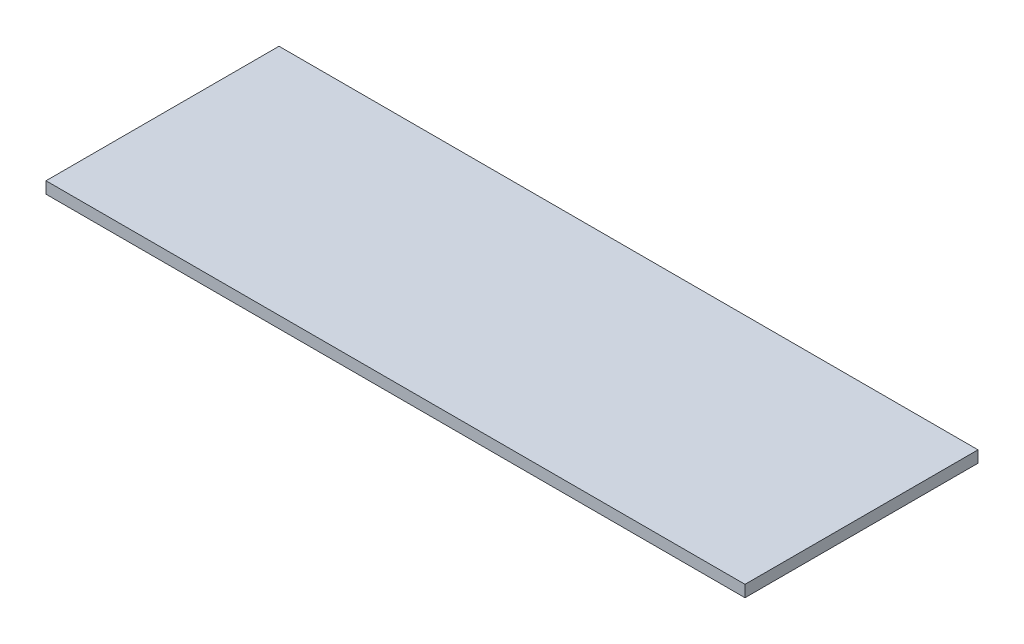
ISO-10303-21;
HEADER;
FILE_DESCRIPTION(('STEP AP214'),'2;1');
FILE_NAME('part.step','',(''),(''),'','','');
FILE_SCHEMA(('AUTOMOTIVE_DESIGN { 1 0 10303 214 1 1 1 1 }'));
ENDSEC;
DATA;
#1=APPLICATION_CONTEXT('core data for automotive mechanical design processes');
#2=APPLICATION_PROTOCOL_DEFINITION('international standard','automotive_design',2000,#1);
#3=PRODUCT_CONTEXT('',#1,'mechanical');
#4=PRODUCT('Part','Part','',(#3));
#5=PRODUCT_RELATED_PRODUCT_CATEGORY('part','',(#4));
#6=PRODUCT_DEFINITION_FORMATION('','',#4);
#7=PRODUCT_DEFINITION_CONTEXT('part definition',#1,'design');
#8=PRODUCT_DEFINITION('design','',#6,#7);
#9=PRODUCT_DEFINITION_SHAPE('','',#8);
#10=(LENGTH_UNIT() NAMED_UNIT(*) SI_UNIT(.MILLI.,.METRE.));
#11=(NAMED_UNIT(*) PLANE_ANGLE_UNIT() SI_UNIT($,.RADIAN.));
#12=(NAMED_UNIT(*) SI_UNIT($,.STERADIAN.) SOLID_ANGLE_UNIT());
#13=UNCERTAINTY_MEASURE_WITH_UNIT(LENGTH_MEASURE(1.E-05),#10,'distance_accuracy_value','');
#14=(GEOMETRIC_REPRESENTATION_CONTEXT(3) GLOBAL_UNCERTAINTY_ASSIGNED_CONTEXT((#13)) GLOBAL_UNIT_ASSIGNED_CONTEXT((#10,
#11,#12)) REPRESENTATION_CONTEXT('',''));
#15=CARTESIAN_POINT('',(0.,0.,0.));
#16=DIRECTION('',(0.,0.,1.));
#17=DIRECTION('',(1.,0.,0.));
#18=AXIS2_PLACEMENT_3D('',#15,#16,#17);
#19=CARTESIAN_POINT('',(0.,0.,1000.));
#20=DIRECTION('',(1.,0.,0.));
#21=DIRECTION('',(0.,0.,-1.));
#22=AXIS2_PLACEMENT_3D('',#19,#20,#21);
#23=PLANE('',#22);
#24=DIRECTION('',(0.,-1.,0.));
#25=VECTOR('',#24,1.);
#26=CARTESIAN_POINT('',(0.,0.,0.));
#27=LINE('',#26,#25);
#28=CARTESIAN_POINT('',(0.,50.,0.));
#29=VERTEX_POINT('',#28);
#30=CARTESIAN_POINT('',(0.,0.,0.));
#31=VERTEX_POINT('',#30);
#32=EDGE_CURVE('E95',#29,#31,#27,.T.);
#33=ORIENTED_EDGE('',*,*,#32,.T.);
#34=DIRECTION('',(0.,0.,-1.));
#35=VECTOR('',#34,1.);
#36=CARTESIAN_POINT('',(0.,0.,1000.));
#37=LINE('',#36,#35);
#38=CARTESIAN_POINT('',(0.,0.,1000.));
#39=VERTEX_POINT('',#38);
#40=EDGE_CURVE('E11',#39,#31,#37,.T.);
#41=ORIENTED_EDGE('',*,*,#40,.F.);
#42=DIRECTION('',(0.,-1.,0.));
#43=VECTOR('',#42,1.);
#44=CARTESIAN_POINT('',(0.,0.,1000.));
#45=LINE('',#44,#43);
#46=CARTESIAN_POINT('',(0.,50.,1000.));
#47=VERTEX_POINT('',#46);
#48=EDGE_CURVE('E83',#47,#39,#45,.T.);
#49=ORIENTED_EDGE('',*,*,#48,.F.);
#50=DIRECTION('',(0.,0.,-1.));
#51=VECTOR('',#50,1.);
#52=CARTESIAN_POINT('',(0.,50.,1000.));
#53=LINE('',#52,#51);
#54=EDGE_CURVE('E91',#47,#29,#53,.T.);
#55=ORIENTED_EDGE('',*,*,#54,.T.);
#56=EDGE_LOOP('',(#33,#41,#49,#55));
#57=FACE_BOUND('',#56,.T.);
#58=ADVANCED_FACE('F32',(#57),#23,.F.);
#59=CARTESIAN_POINT('',(0.,0.,1000.));
#60=DIRECTION('',(0.,1.,0.));
#61=DIRECTION('',(0.,0.,1.));
#62=AXIS2_PLACEMENT_3D('',#59,#60,#61);
#63=PLANE('',#62);
#64=DIRECTION('',(1.,0.,0.));
#65=VECTOR('',#64,1.);
#66=CARTESIAN_POINT('',(0.,0.,0.));
#67=LINE('',#66,#65);
#68=CARTESIAN_POINT('',(3000.,0.,0.));
#69=VERTEX_POINT('',#68);
#70=EDGE_CURVE('E87',#31,#69,#67,.T.);
#71=ORIENTED_EDGE('',*,*,#70,.T.);
#72=DIRECTION('',(0.,0.,-1.));
#73=VECTOR('',#72,1.);
#74=CARTESIAN_POINT('',(3000.,0.,1000.));
#75=LINE('',#74,#73);
#76=CARTESIAN_POINT('',(3000.,0.,1000.));
#77=VERTEX_POINT('',#76);
#78=EDGE_CURVE('E40',#77,#69,#75,.T.);
#79=ORIENTED_EDGE('',*,*,#78,.F.);
#80=DIRECTION('',(1.,0.,0.));
#81=VECTOR('',#80,1.);
#82=CARTESIAN_POINT('',(0.,0.,1000.));
#83=LINE('',#82,#81);
#84=EDGE_CURVE('E78',#39,#77,#83,.T.);
#85=ORIENTED_EDGE('',*,*,#84,.F.);
#86=ORIENTED_EDGE('',*,*,#40,.T.);
#87=EDGE_LOOP('',(#71,#79,#85,#86));
#88=FACE_BOUND('',#87,.T.);
#89=ADVANCED_FACE('F86',(#88),#63,.F.);
#90=CARTESIAN_POINT('',(3000.,0.,1000.));
#91=DIRECTION('',(-1.,0.,0.));
#92=DIRECTION('',(0.,0.,1.));
#93=AXIS2_PLACEMENT_3D('',#90,#91,#92);
#94=PLANE('',#93);
#95=DIRECTION('',(0.,1.,0.));
#96=VECTOR('',#95,1.);
#97=CARTESIAN_POINT('',(3000.,0.,0.));
#98=LINE('',#97,#96);
#99=CARTESIAN_POINT('',(3000.,50.,0.));
#100=VERTEX_POINT('',#99);
#101=EDGE_CURVE('E65',#69,#100,#98,.T.);
#102=ORIENTED_EDGE('',*,*,#101,.T.);
#103=DIRECTION('',(0.,0.,-1.));
#104=VECTOR('',#103,1.);
#105=CARTESIAN_POINT('',(3000.,50.,1000.));
#106=LINE('',#105,#104);
#107=CARTESIAN_POINT('',(3000.,50.,1000.));
#108=VERTEX_POINT('',#107);
#109=EDGE_CURVE('E88',#108,#100,#106,.T.);
#110=ORIENTED_EDGE('',*,*,#109,.F.);
#111=DIRECTION('',(0.,1.,0.));
#112=VECTOR('',#111,1.);
#113=CARTESIAN_POINT('',(3000.,0.,1000.));
#114=LINE('',#113,#112);
#115=EDGE_CURVE('E81',#77,#108,#114,.T.);
#116=ORIENTED_EDGE('',*,*,#115,.F.);
#117=ORIENTED_EDGE('',*,*,#78,.T.);
#118=EDGE_LOOP('',(#102,#110,#116,#117));
#119=FACE_BOUND('',#118,.T.);
#120=ADVANCED_FACE('F89',(#119),#94,.F.);
#121=CARTESIAN_POINT('',(0.,50.,1000.));
#122=DIRECTION('',(0.,-1.,0.));
#123=DIRECTION('',(0.,0.,-1.));
#124=AXIS2_PLACEMENT_3D('',#121,#122,#123);
#125=PLANE('',#124);
#126=DIRECTION('',(-1.,0.,0.));
#127=VECTOR('',#126,1.);
#128=CARTESIAN_POINT('',(0.,50.,0.));
#129=LINE('',#128,#127);
#130=EDGE_CURVE('E71',#100,#29,#129,.T.);
#131=ORIENTED_EDGE('',*,*,#130,.T.);
#132=ORIENTED_EDGE('',*,*,#54,.F.);
#133=DIRECTION('',(-1.,0.,0.));
#134=VECTOR('',#133,1.);
#135=CARTESIAN_POINT('',(0.,50.,1000.));
#136=LINE('',#135,#134);
#137=EDGE_CURVE('E48',#108,#47,#136,.T.);
#138=ORIENTED_EDGE('',*,*,#137,.F.);
#139=ORIENTED_EDGE('',*,*,#109,.T.);
#140=EDGE_LOOP('',(#131,#132,#138,#139));
#141=FACE_BOUND('',#140,.T.);
#142=ADVANCED_FACE('F102',(#141),#125,.F.);
#143=CARTESIAN_POINT('',(0.,0.,1000.));
#144=DIRECTION('',(0.,0.,-1.));
#145=DIRECTION('',(-1.,0.,0.));
#146=AXIS2_PLACEMENT_3D('',#143,#144,#145);
#147=PLANE('',#146);
#148=ORIENTED_EDGE('',*,*,#48,.T.);
#149=ORIENTED_EDGE('',*,*,#84,.T.);
#150=ORIENTED_EDGE('',*,*,#115,.T.);
#151=ORIENTED_EDGE('',*,*,#137,.T.);
#152=EDGE_LOOP('',(#148,#149,#150,#151));
#153=FACE_BOUND('',#152,.T.);
#154=ADVANCED_FACE('F79',(#153),#147,.F.);
#155=CARTESIAN_POINT('',(0.,0.,0.));
#156=DIRECTION('',(0.,0.,-1.));
#157=DIRECTION('',(-1.,0.,0.));
#158=AXIS2_PLACEMENT_3D('',#155,#156,#157);
#159=PLANE('',#158);
#160=ORIENTED_EDGE('',*,*,#32,.F.);
#161=ORIENTED_EDGE('',*,*,#130,.F.);
#162=ORIENTED_EDGE('',*,*,#101,.F.);
#163=ORIENTED_EDGE('',*,*,#70,.F.);
#164=EDGE_LOOP('',(#160,#161,#162,#163));
#165=FACE_BOUND('',#164,.T.);
#166=ADVANCED_FACE('F105',(#165),#159,.T.);
#167=CLOSED_SHELL('',(#58,#89,#120,#142,#154,#166));
#168=MANIFOLD_SOLID_BREP('B2',#167);
#169=ADVANCED_BREP_SHAPE_REPRESENTATION('',(#18,#168),#14);
#170=SHAPE_DEFINITION_REPRESENTATION(#9,#169);
ENDSEC;
END-ISO-10303-21;
